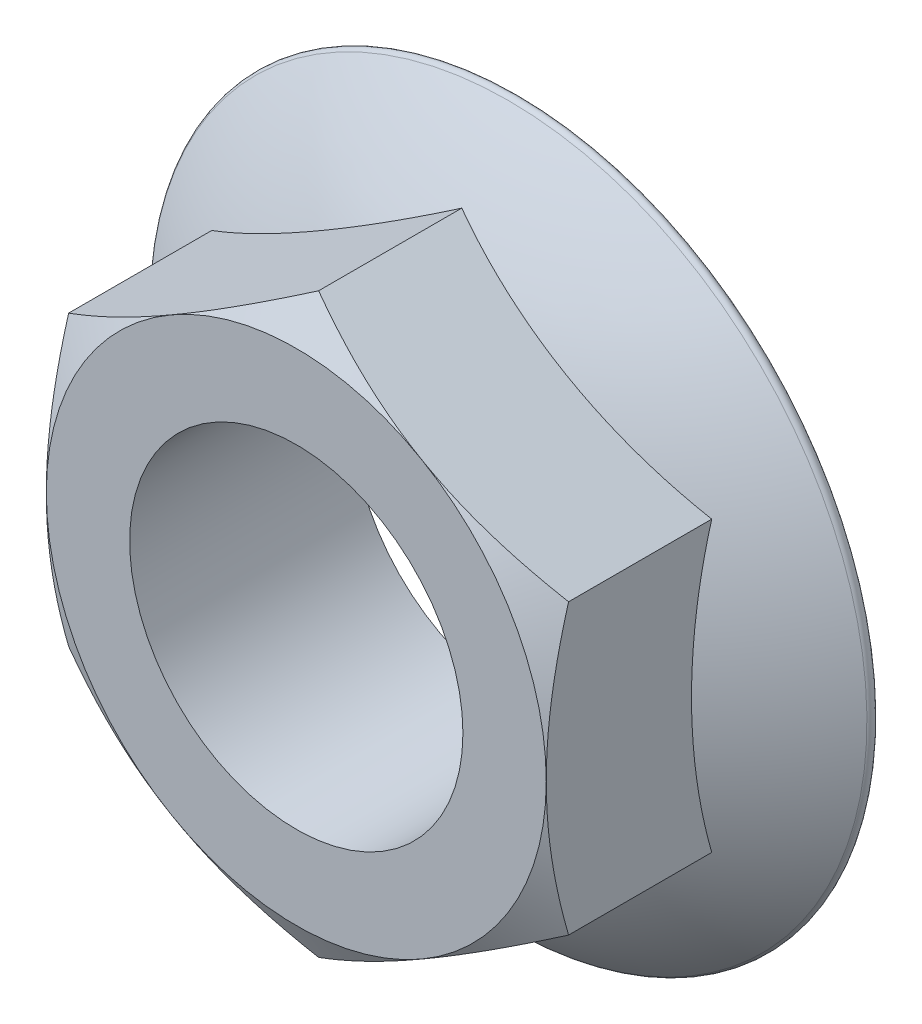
from build123d import *

# Parameters (mm, degrees)
BOSS_EXTRUDE1_DEPTH = 20
SKETCH3_OUTSIDE_W   = 154.97
SKETCH3_OUTSIDE_H   = 154.97
SKETCH3_OUTSIDE_R   = 22.5
CUT_EXTRUDE1_DEPTH  = 20
CUT_EXTRUDE1_DRAFT  = -60
SKETCH4_R           = 15
CUT_EXTRUDE2_DEPTH  = 51.060014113


with BuildPart() as part:
    # Sketch1 → Boss-Extrude1 (new body)
    with BuildSketch(Plane.XY):
        Polygon((22.5, -12.990381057), (22.5, 12.990381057), (0, 25.980762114), (-22.5, 12.990381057), (-22.5, -12.990381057), (0, -25.980762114), align=None)
    extrude(amount=BOSS_EXTRUDE1_DEPTH)

    # Sketch2 → Revolve1 (revolve)
    with BuildSketch(Plane(origin=(0, 0, 0), x_dir=(0, 0, -1), z_dir=(1, 0, 0)), mode=Mode.PRIVATE) as revolve1_sk:
        with BuildLine():
            Line((0, 0), (-12, 0))
            ThreePointArc((-12, 0), (-9.145772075, -17.058051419), (-0.894027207, -32.257802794))
            ThreePointArc((-0.894027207, -32.257802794), (-0.337232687, -32.42276506), (0, -31.95))
            Line((0, -31.95), (0, 0))
        make_face()
    revolve(revolve1_sk.sketch.rotate(Axis((0, 0, 0), (0, 0, 1)), 180), axis=Axis((0, 0, 0), (0, 0, 1)))


with BuildPart() as cut_extrude1_tool:
    # Sketch3 outside → Cut-Extrude1 (with draft: the straight prism first)
    with BuildSketch(Plane.XY.offset(20)):
        Rectangle(SKETCH3_OUTSIDE_W, SKETCH3_OUTSIDE_H)
        Circle(SKETCH3_OUTSIDE_R, mode=Mode.SUBTRACT)
    extrude(amount=-CUT_EXTRUDE1_DEPTH)
    # Cut-Extrude1: the draft: its side faces are tilted about the plane it starts from
    cut_extrude1_sides = [cut_extrude1_tool.faces().sort_by_distance(p)[0] for p in [
        (0, -77.485, 10),
        (77.485, 0, 10),
        (0, 77.485, 10),
        (-77.485, 0, 10),
        (-22.5, 0, 10),
    ]]
    draft(cut_extrude1_sides, Plane.XY.offset(20), CUT_EXTRUDE1_DRAFT)


with BuildPart() as part_1:
    add(part.part)

    # Cut-Extrude1: cut by cut_extrude1_tool
    add(cut_extrude1_tool.part, mode=Mode.SUBTRACT)

    # Sketch4 → Cut-Extrude2 (cut, through all)
    with BuildSketch(Plane.XY.offset(20)):
        Circle(SKETCH4_R)
    extrude(amount=-CUT_EXTRUDE2_DEPTH, mode=Mode.SUBTRACT)


solid = part_1.part
